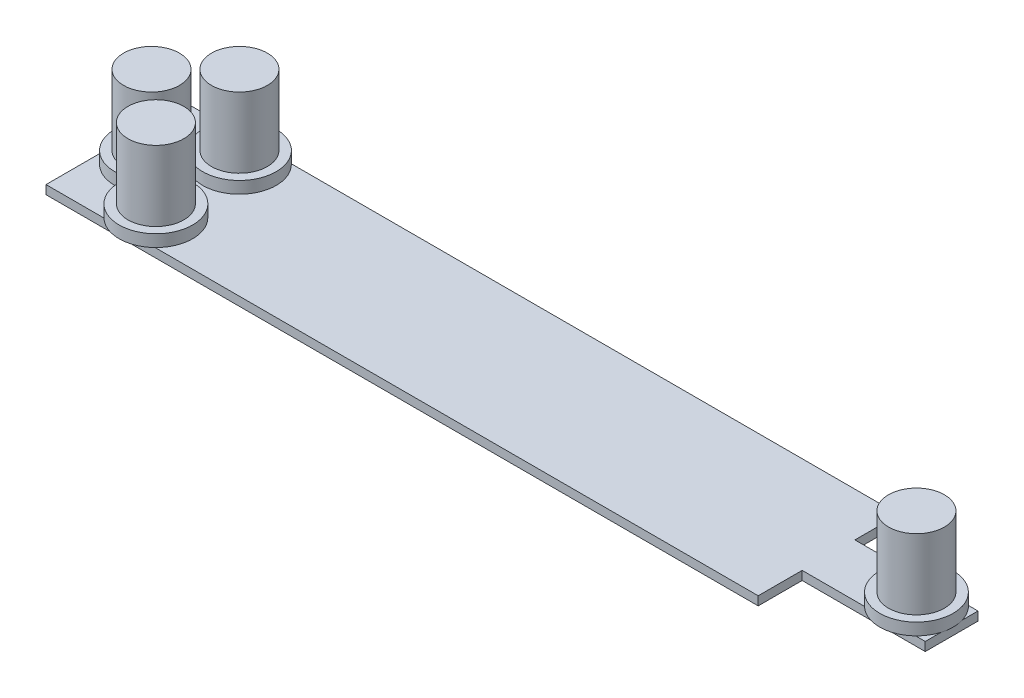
from build123d import *

# Parameters (mm, degrees)
BOSS_EXTRUDE1_DEPTH = 1
SKETCH4_R           = 4.18
BOSS_EXTRUDE2_DEPTH = 1.36
SKETCH5_R           = 3.18
BOSS_EXTRUDE3_DEPTH = 8


with BuildPart() as part:
    # Sketch1 → Boss-Extrude1 (new body)
    with BuildSketch(Plane(origin=(0, 0, 0), x_dir=(1, 0, 0), z_dir=(0, 1, 0))):
        Polygon((47.5, 3), (33.5, 3), (33.5, 8), (-47.5, 8), (-47.5, -8), (33.5, -8), (33.5, -3), (47.5, -3), align=None)
    extrude(amount=BOSS_EXTRUDE1_DEPTH)

    # Sketch4 → Boss-Extrude2 (add)
    with BuildSketch(Plane(origin=(0, 1, 0), x_dir=(1, 0, 0), z_dir=(0, 1, 0))):
        with Locations(Location((-38.5, 5, 0), (0, 0, 134.134811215))):
            Circle(SKETCH4_R)
        with Locations(Location((-38, -5, 0), (0, 0, 225.865188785))):
            Circle(SKETCH4_R)
        with Locations(Location((43.5, 0, 0), (0, 0, 45.865188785))):
            Circle(SKETCH4_R)
        with BuildLine():
            Line((-42.519515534, -4.063379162), (-40.318249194, -0.701457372))
            Line((-40.318249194, -0.701457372), (-40.318249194, 0.443486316))
            Line((-40.318249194, 0.443486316), (-43.280380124, 4.174226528))
            ThreePointArc((-43.280380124, 4.174226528), (-47.662282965, -0.384448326), (-42.519515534, -4.063379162))
        make_face()
    extrude(amount=BOSS_EXTRUDE2_DEPTH)

    # Sketch5 → Boss-Extrude3 (add)
    with BuildSketch(Plane(origin=(0, 2.36, 0), x_dir=(1, 0, 0), z_dir=(0, 1, 0))):
        with Locations(Location((-38.5, 5, 0), (0, 0, 270))):
            Circle(SKETCH5_R)
        with Locations(Location((-43.5, 0, 0), (0, 0, 67.953718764))):
            Circle(SKETCH5_R)
        with Locations(Location((-38, -5, 0), (0, 0, 270))):
            Circle(SKETCH5_R)
        with Locations(Location((43.5, 0, 0), (0, 0, 270))):
            Circle(SKETCH5_R)
    extrude(amount=BOSS_EXTRUDE3_DEPTH)


solid = part.part
